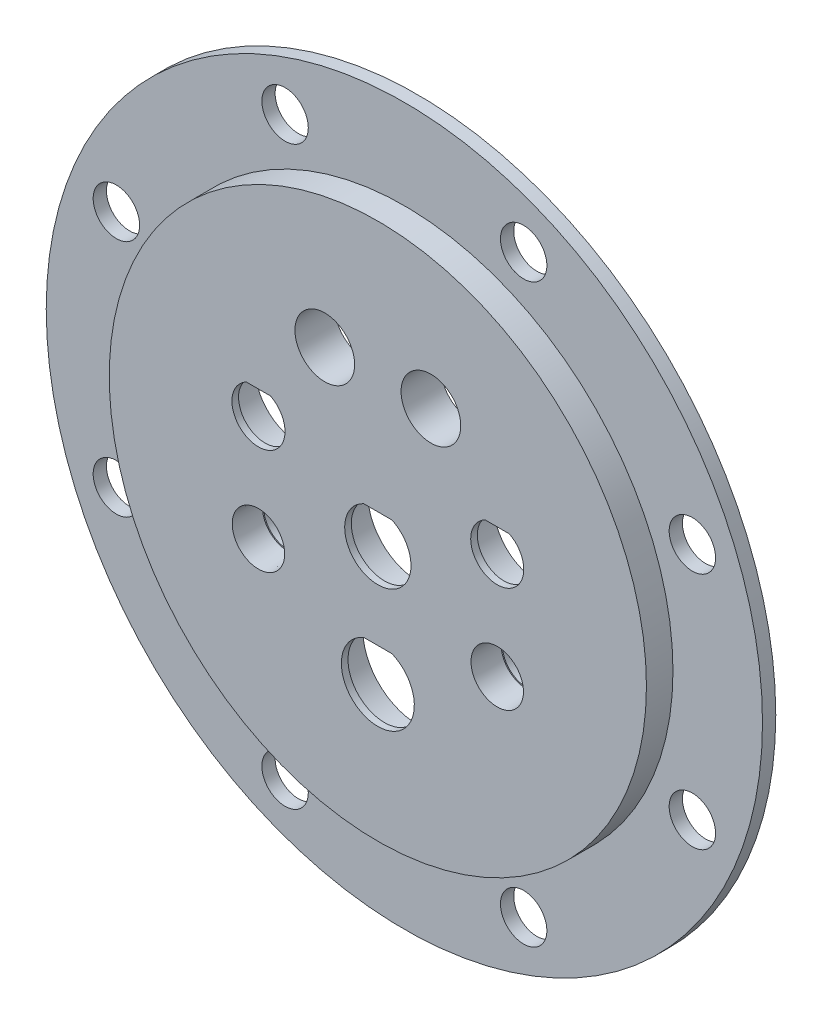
ISO-10303-21;
HEADER;
FILE_DESCRIPTION(('STEP AP214'),'2;1');
FILE_NAME('part.step','',(''),(''),'','','');
FILE_SCHEMA(('AUTOMOTIVE_DESIGN { 1 0 10303 214 1 1 1 1 }'));
ENDSEC;
DATA;
#1=APPLICATION_CONTEXT('core data for automotive mechanical design processes');
#2=APPLICATION_PROTOCOL_DEFINITION('international standard','automotive_design',2000,#1);
#3=PRODUCT_CONTEXT('',#1,'mechanical');
#4=PRODUCT('Part','Part','',(#3));
#5=PRODUCT_RELATED_PRODUCT_CATEGORY('part','',(#4));
#6=PRODUCT_DEFINITION_FORMATION('','',#4);
#7=PRODUCT_DEFINITION_CONTEXT('part definition',#1,'design');
#8=PRODUCT_DEFINITION('design','',#6,#7);
#9=PRODUCT_DEFINITION_SHAPE('','',#8);
#10=(LENGTH_UNIT() NAMED_UNIT(*) SI_UNIT(.MILLI.,.METRE.));
#11=(NAMED_UNIT(*) PLANE_ANGLE_UNIT() SI_UNIT($,.RADIAN.));
#12=(NAMED_UNIT(*) SI_UNIT($,.STERADIAN.) SOLID_ANGLE_UNIT());
#13=UNCERTAINTY_MEASURE_WITH_UNIT(LENGTH_MEASURE(1.E-05),#10,'distance_accuracy_value','');
#14=(GEOMETRIC_REPRESENTATION_CONTEXT(3) GLOBAL_UNCERTAINTY_ASSIGNED_CONTEXT((#13)) GLOBAL_UNIT_ASSIGNED_CONTEXT((#10,
#11,#12)) REPRESENTATION_CONTEXT('',''));
#15=CARTESIAN_POINT('',(0.,0.,0.));
#16=DIRECTION('',(0.,0.,1.));
#17=DIRECTION('',(1.,0.,0.));
#18=AXIS2_PLACEMENT_3D('',#15,#16,#17);
#19=CARTESIAN_POINT('',(0.,-63.5,0.));
#20=DIRECTION('',(0.,0.,1.));
#21=DIRECTION('',(1.,0.,0.));
#22=AXIS2_PLACEMENT_3D('',#19,#20,#21);
#23=CYLINDRICAL_SURFACE('',#22,17.4625);
#24=CARTESIAN_POINT('',(0.,-63.5,15.875));
#25=DIRECTION('',(0.,0.,-1.));
#26=DIRECTION('',(-1.,0.,0.));
#27=AXIS2_PLACEMENT_3D('',#24,#25,#26);
#28=CIRCLE('',#27,17.4625);
#29=CARTESIAN_POINT('',(-6.81398495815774,-47.4218,15.875));
#30=VERTEX_POINT('',#29);
#31=CARTESIAN_POINT('',(6.81398495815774,-47.4218,15.875));
#32=VERTEX_POINT('',#31);
#33=EDGE_CURVE('E50',#30,#32,#28,.F.);
#34=ORIENTED_EDGE('',*,*,#33,.F.);
#35=DIRECTION('',(0.,0.,1.));
#36=VECTOR('',#35,1.);
#37=CARTESIAN_POINT('',(-6.81398495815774,-47.4218,0.));
#38=LINE('',#37,#36);
#39=CARTESIAN_POINT('',(-6.81398495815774,-47.4218,19.05));
#40=VERTEX_POINT('',#39);
#41=EDGE_CURVE('E104',#30,#40,#38,.T.);
#42=ORIENTED_EDGE('',*,*,#41,.T.);
#43=CARTESIAN_POINT('',(0.,-63.5,19.05));
#44=DIRECTION('',(0.,0.,1.));
#45=DIRECTION('',(1.,0.,0.));
#46=AXIS2_PLACEMENT_3D('',#43,#44,#45);
#47=CIRCLE('',#46,17.4625);
#48=CARTESIAN_POINT('',(6.81398495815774,-47.4218,19.05));
#49=VERTEX_POINT('',#48);
#50=EDGE_CURVE('E478',#40,#49,#47,.T.);
#51=ORIENTED_EDGE('',*,*,#50,.T.);
#52=DIRECTION('',(0.,0.,1.));
#53=VECTOR('',#52,1.);
#54=CARTESIAN_POINT('',(6.81398495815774,-47.4218,0.));
#55=LINE('',#54,#53);
#56=EDGE_CURVE('E106',#32,#49,#55,.T.);
#57=ORIENTED_EDGE('',*,*,#56,.F.);
#58=EDGE_LOOP('',(#34,#42,#51,#57));
#59=FACE_BOUND('',#58,.T.);
#60=ADVANCED_FACE('F37',(#59),#23,.F.);
#61=CARTESIAN_POINT('',(-6.81398495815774,-47.4218,0.));
#62=DIRECTION('',(0.,1.,0.));
#63=DIRECTION('',(0.,0.,1.));
#64=AXIS2_PLACEMENT_3D('',#61,#62,#63);
#65=PLANE('',#64);
#66=DIRECTION('',(-1.,0.,0.));
#67=VECTOR('',#66,1.);
#68=CARTESIAN_POINT('',(-6.81398495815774,-47.4218,15.875));
#69=LINE('',#68,#67);
#70=EDGE_CURVE('E11',#32,#30,#69,.T.);
#71=ORIENTED_EDGE('',*,*,#70,.F.);
#72=ORIENTED_EDGE('',*,*,#56,.T.);
#73=DIRECTION('',(-1.,0.,0.));
#74=VECTOR('',#73,1.);
#75=CARTESIAN_POINT('',(-6.81398495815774,-47.4218,19.05));
#76=LINE('',#75,#74);
#77=EDGE_CURVE('E112',#49,#40,#76,.T.);
#78=ORIENTED_EDGE('',*,*,#77,.T.);
#79=ORIENTED_EDGE('',*,*,#41,.F.);
#80=EDGE_LOOP('',(#71,#72,#78,#79));
#81=FACE_BOUND('',#80,.T.);
#82=ADVANCED_FACE('F110',(#81),#65,.F.);
#83=CARTESIAN_POINT('',(0.,-6.35,0.));
#84=DIRECTION('',(0.,0.,1.));
#85=DIRECTION('',(1.,0.,0.));
#86=AXIS2_PLACEMENT_3D('',#83,#84,#85);
#87=CYLINDRICAL_SURFACE('',#86,15.875);
#88=CARTESIAN_POINT('',(0.,-6.35,15.875));
#89=DIRECTION('',(0.,0.,-1.));
#90=DIRECTION('',(-1.,0.,0.));
#91=AXIS2_PLACEMENT_3D('',#88,#89,#90);
#92=CIRCLE('',#91,15.875);
#93=CARTESIAN_POINT('',(-6.7870777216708,8.00099999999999,15.875));
#94=VERTEX_POINT('',#93);
#95=CARTESIAN_POINT('',(6.7870777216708,8.00099999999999,15.875));
#96=VERTEX_POINT('',#95);
#97=EDGE_CURVE('E57',#94,#96,#92,.F.);
#98=ORIENTED_EDGE('',*,*,#97,.F.);
#99=DIRECTION('',(0.,0.,1.));
#100=VECTOR('',#99,1.);
#101=CARTESIAN_POINT('',(-6.7870777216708,8.00099999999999,0.));
#102=LINE('',#101,#100);
#103=CARTESIAN_POINT('',(-6.7870777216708,8.00099999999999,19.05));
#104=VERTEX_POINT('',#103);
#105=EDGE_CURVE('E146',#94,#104,#102,.T.);
#106=ORIENTED_EDGE('',*,*,#105,.T.);
#107=CARTESIAN_POINT('',(0.,-6.35,19.05));
#108=DIRECTION('',(0.,0.,1.));
#109=DIRECTION('',(1.,0.,0.));
#110=AXIS2_PLACEMENT_3D('',#107,#108,#109);
#111=CIRCLE('',#110,15.875);
#112=CARTESIAN_POINT('',(6.7870777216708,8.00099999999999,19.05));
#113=VERTEX_POINT('',#112);
#114=EDGE_CURVE('E138',#104,#113,#111,.T.);
#115=ORIENTED_EDGE('',*,*,#114,.T.);
#116=DIRECTION('',(0.,0.,1.));
#117=VECTOR('',#116,1.);
#118=CARTESIAN_POINT('',(6.7870777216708,8.00099999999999,0.));
#119=LINE('',#118,#117);
#120=EDGE_CURVE('E145',#96,#113,#119,.T.);
#121=ORIENTED_EDGE('',*,*,#120,.F.);
#122=EDGE_LOOP('',(#98,#106,#115,#121));
#123=FACE_BOUND('',#122,.T.);
#124=ADVANCED_FACE('F253',(#123),#87,.F.);
#125=CARTESIAN_POINT('',(6.7870777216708,8.00099999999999,0.));
#126=DIRECTION('',(0.,1.,0.));
#127=DIRECTION('',(0.,0.,1.));
#128=AXIS2_PLACEMENT_3D('',#125,#126,#127);
#129=PLANE('',#128);
#130=DIRECTION('',(-1.,0.,0.));
#131=VECTOR('',#130,1.);
#132=CARTESIAN_POINT('',(6.7870777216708,8.00099999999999,15.875));
#133=LINE('',#132,#131);
#134=EDGE_CURVE('E45',#96,#94,#133,.T.);
#135=ORIENTED_EDGE('',*,*,#134,.F.);
#136=ORIENTED_EDGE('',*,*,#120,.T.);
#137=DIRECTION('',(-1.,0.,0.));
#138=VECTOR('',#137,1.);
#139=CARTESIAN_POINT('',(6.7870777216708,8.00099999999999,19.05));
#140=LINE('',#139,#138);
#141=EDGE_CURVE('E142',#113,#104,#140,.T.);
#142=ORIENTED_EDGE('',*,*,#141,.T.);
#143=ORIENTED_EDGE('',*,*,#105,.F.);
#144=EDGE_LOOP('',(#135,#136,#142,#143));
#145=FACE_BOUND('',#144,.T.);
#146=ADVANCED_FACE('F257',(#145),#129,.F.);
#147=CARTESIAN_POINT('',(-57.15,19.05,0.));
#148=DIRECTION('',(0.,0.,1.));
#149=DIRECTION('',(1.,0.,0.));
#150=AXIS2_PLACEMENT_3D('',#147,#148,#149);
#151=CYLINDRICAL_SURFACE('',#150,12.7);
#152=CARTESIAN_POINT('',(-57.15,19.05,15.875));
#153=DIRECTION('',(0.,0.,-1.));
#154=DIRECTION('',(-1.,0.,0.));
#155=AXIS2_PLACEMENT_3D('',#152,#153,#154);
#156=CIRCLE('',#155,12.7);
#157=CARTESIAN_POINT('',(-62.9406986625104,30.353,15.875));
#158=VERTEX_POINT('',#157);
#159=CARTESIAN_POINT('',(-51.3593013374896,30.353,15.875));
#160=VERTEX_POINT('',#159);
#161=EDGE_CURVE('E470',#158,#160,#156,.F.);
#162=ORIENTED_EDGE('',*,*,#161,.F.);
#163=DIRECTION('',(0.,0.,1.));
#164=VECTOR('',#163,1.);
#165=CARTESIAN_POINT('',(-62.9406986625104,30.353,0.));
#166=LINE('',#165,#164);
#167=CARTESIAN_POINT('',(-62.9406986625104,30.353,19.05));
#168=VERTEX_POINT('',#167);
#169=EDGE_CURVE('E136',#158,#168,#166,.T.);
#170=ORIENTED_EDGE('',*,*,#169,.T.);
#171=CARTESIAN_POINT('',(-57.15,19.05,19.05));
#172=DIRECTION('',(0.,0.,1.));
#173=DIRECTION('',(1.,0.,0.));
#174=AXIS2_PLACEMENT_3D('',#171,#172,#173);
#175=CIRCLE('',#174,12.7);
#176=CARTESIAN_POINT('',(-51.3593013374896,30.353,19.05));
#177=VERTEX_POINT('',#176);
#178=EDGE_CURVE('E128',#168,#177,#175,.T.);
#179=ORIENTED_EDGE('',*,*,#178,.T.);
#180=DIRECTION('',(0.,0.,1.));
#181=VECTOR('',#180,1.);
#182=CARTESIAN_POINT('',(-51.3593013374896,30.353,0.));
#183=LINE('',#182,#181);
#184=EDGE_CURVE('E135',#160,#177,#183,.T.);
#185=ORIENTED_EDGE('',*,*,#184,.F.);
#186=EDGE_LOOP('',(#162,#170,#179,#185));
#187=FACE_BOUND('',#186,.T.);
#188=ADVANCED_FACE('F308',(#187),#151,.F.);
#189=CARTESIAN_POINT('',(-62.9406986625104,30.353,0.));
#190=DIRECTION('',(0.,1.,0.));
#191=DIRECTION('',(0.,0.,1.));
#192=AXIS2_PLACEMENT_3D('',#189,#190,#191);
#193=PLANE('',#192);
#194=DIRECTION('',(-1.,0.,0.));
#195=VECTOR('',#194,1.);
#196=CARTESIAN_POINT('',(-62.9406986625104,30.353,15.875));
#197=LINE('',#196,#195);
#198=EDGE_CURVE('E247',#160,#158,#197,.T.);
#199=ORIENTED_EDGE('',*,*,#198,.F.);
#200=ORIENTED_EDGE('',*,*,#184,.T.);
#201=DIRECTION('',(-1.,0.,0.));
#202=VECTOR('',#201,1.);
#203=CARTESIAN_POINT('',(-62.9406986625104,30.353,19.05));
#204=LINE('',#203,#202);
#205=EDGE_CURVE('E132',#177,#168,#204,.T.);
#206=ORIENTED_EDGE('',*,*,#205,.T.);
#207=ORIENTED_EDGE('',*,*,#169,.F.);
#208=EDGE_LOOP('',(#199,#200,#206,#207));
#209=FACE_BOUND('',#208,.T.);
#210=ADVANCED_FACE('F304',(#209),#193,.F.);
#211=CARTESIAN_POINT('',(57.15,19.05,0.));
#212=DIRECTION('',(0.,0.,1.));
#213=DIRECTION('',(1.,0.,0.));
#214=AXIS2_PLACEMENT_3D('',#211,#212,#213);
#215=CYLINDRICAL_SURFACE('',#214,12.7);
#216=CARTESIAN_POINT('',(57.15,19.05,15.875));
#217=DIRECTION('',(0.,0.,-1.));
#218=DIRECTION('',(-1.,0.,0.));
#219=AXIS2_PLACEMENT_3D('',#216,#217,#218);
#220=CIRCLE('',#219,12.7);
#221=CARTESIAN_POINT('',(51.3593013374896,30.353,15.875));
#222=VERTEX_POINT('',#221);
#223=CARTESIAN_POINT('',(62.9406986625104,30.353,15.875));
#224=VERTEX_POINT('',#223);
#225=EDGE_CURVE('E473',#222,#224,#220,.F.);
#226=ORIENTED_EDGE('',*,*,#225,.F.);
#227=DIRECTION('',(0.,0.,1.));
#228=VECTOR('',#227,1.);
#229=CARTESIAN_POINT('',(51.3593013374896,30.353,0.));
#230=LINE('',#229,#228);
#231=CARTESIAN_POINT('',(51.3593013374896,30.353,19.05));
#232=VERTEX_POINT('',#231);
#233=EDGE_CURVE('E126',#222,#232,#230,.T.);
#234=ORIENTED_EDGE('',*,*,#233,.T.);
#235=CARTESIAN_POINT('',(57.15,19.05,19.05));
#236=DIRECTION('',(0.,0.,1.));
#237=DIRECTION('',(1.,0.,0.));
#238=AXIS2_PLACEMENT_3D('',#235,#236,#237);
#239=CIRCLE('',#238,12.7);
#240=CARTESIAN_POINT('',(62.9406986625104,30.353,19.05));
#241=VERTEX_POINT('',#240);
#242=EDGE_CURVE('E114',#232,#241,#239,.T.);
#243=ORIENTED_EDGE('',*,*,#242,.T.);
#244=DIRECTION('',(0.,0.,1.));
#245=VECTOR('',#244,1.);
#246=CARTESIAN_POINT('',(62.9406986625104,30.353,0.));
#247=LINE('',#246,#245);
#248=EDGE_CURVE('E125',#224,#241,#247,.T.);
#249=ORIENTED_EDGE('',*,*,#248,.F.);
#250=EDGE_LOOP('',(#226,#234,#243,#249));
#251=FACE_BOUND('',#250,.T.);
#252=ADVANCED_FACE('F300',(#251),#215,.F.);
#253=CARTESIAN_POINT('',(51.3593013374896,30.353,0.));
#254=DIRECTION('',(0.,1.,0.));
#255=DIRECTION('',(0.,0.,1.));
#256=AXIS2_PLACEMENT_3D('',#253,#254,#255);
#257=PLANE('',#256);
#258=DIRECTION('',(-1.,0.,0.));
#259=VECTOR('',#258,1.);
#260=CARTESIAN_POINT('',(51.3593013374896,30.353,15.875));
#261=LINE('',#260,#259);
#262=EDGE_CURVE('E245',#224,#222,#261,.T.);
#263=ORIENTED_EDGE('',*,*,#262,.F.);
#264=ORIENTED_EDGE('',*,*,#248,.T.);
#265=DIRECTION('',(-1.,0.,0.));
#266=VECTOR('',#265,1.);
#267=CARTESIAN_POINT('',(51.3593013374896,30.353,19.05));
#268=LINE('',#267,#266);
#269=EDGE_CURVE('E117',#241,#232,#268,.T.);
#270=ORIENTED_EDGE('',*,*,#269,.T.);
#271=ORIENTED_EDGE('',*,*,#233,.F.);
#272=EDGE_LOOP('',(#263,#264,#270,#271));
#273=FACE_BOUND('',#272,.T.);
#274=ADVANCED_FACE('F297',(#273),#257,.F.);
#275=CARTESIAN_POINT('',(0.,0.,19.05));
#276=DIRECTION('',(0.,0.,-1.));
#277=DIRECTION('',(-1.,0.,0.));
#278=AXIS2_PLACEMENT_3D('',#275,#276,#277);
#279=CYLINDRICAL_SURFACE('',#278,171.45);
#280=CARTESIAN_POINT('',(0.,0.,0.));
#281=DIRECTION('',(0.,0.,1.));
#282=DIRECTION('',(1.,0.,0.));
#283=AXIS2_PLACEMENT_3D('',#280,#281,#282);
#284=CIRCLE('',#283,171.45);
#285=CARTESIAN_POINT('',(-171.45,0.,0.));
#286=VERTEX_POINT('',#285);
#287=EDGE_CURVE('E242',#286,#286,#284,.T.);
#288=CARTESIAN_POINT('',(0.,0.,6.35));
#289=DIRECTION('',(0.,0.,1.));
#290=DIRECTION('',(1.,0.,0.));
#291=AXIS2_PLACEMENT_3D('',#288,#289,#290);
#292=CIRCLE('',#291,171.45);
#293=CARTESIAN_POINT('',(-171.45,0.,6.35));
#294=VERTEX_POINT('',#293);
#295=EDGE_CURVE('E237',#294,#294,#292,.T.);
#296=CARTESIAN_POINT('',(-171.45,0.,0.));
#297=CARTESIAN_POINT('',(-171.45,0.,0.0661458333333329));
#298=CARTESIAN_POINT('',(-171.45,0.,0.132291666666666));
#299=CARTESIAN_POINT('',(-171.45,0.,0.264583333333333));
#300=CARTESIAN_POINT('',(-171.45,0.,0.330729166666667));
#301=CARTESIAN_POINT('',(-171.45,0.,0.463020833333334));
#302=CARTESIAN_POINT('',(-171.45,0.,0.529166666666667));
#303=CARTESIAN_POINT('',(-171.45,0.,0.661458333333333));
#304=CARTESIAN_POINT('',(-171.45,0.,0.727604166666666));
#305=CARTESIAN_POINT('',(-171.45,0.,0.859895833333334));
#306=CARTESIAN_POINT('',(-171.45,0.,0.926041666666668));
#307=CARTESIAN_POINT('',(-171.45,0.,1.05833333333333));
#308=CARTESIAN_POINT('',(-171.45,0.,1.12447916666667));
#309=CARTESIAN_POINT('',(-171.45,0.,1.25677083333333));
#310=CARTESIAN_POINT('',(-171.45,0.,1.32291666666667));
#311=CARTESIAN_POINT('',(-171.45,0.,1.45520833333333));
#312=CARTESIAN_POINT('',(-171.45,0.,1.52135416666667));
#313=CARTESIAN_POINT('',(-171.45,0.,1.65364583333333));
#314=CARTESIAN_POINT('',(-171.45,0.,1.71979166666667));
#315=CARTESIAN_POINT('',(-171.45,0.,1.85208333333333));
#316=CARTESIAN_POINT('',(-171.45,0.,1.91822916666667));
#317=CARTESIAN_POINT('',(-171.45,0.,2.05052083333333));
#318=CARTESIAN_POINT('',(-171.45,0.,2.11666666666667));
#319=CARTESIAN_POINT('',(-171.45,0.,2.24895833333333));
#320=CARTESIAN_POINT('',(-171.45,0.,2.31510416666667));
#321=CARTESIAN_POINT('',(-171.45,0.,2.44739583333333));
#322=CARTESIAN_POINT('',(-171.45,0.,2.51354166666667));
#323=CARTESIAN_POINT('',(-171.45,0.,2.64583333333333));
#324=CARTESIAN_POINT('',(-171.45,0.,2.71197916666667));
#325=CARTESIAN_POINT('',(-171.45,0.,2.84427083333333));
#326=CARTESIAN_POINT('',(-171.45,0.,2.91041666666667));
#327=CARTESIAN_POINT('',(-171.45,0.,3.04270833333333));
#328=CARTESIAN_POINT('',(-171.45,0.,3.10885416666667));
#329=CARTESIAN_POINT('',(-171.45,0.,3.24114583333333));
#330=CARTESIAN_POINT('',(-171.45,0.,3.30729166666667));
#331=CARTESIAN_POINT('',(-171.45,0.,3.43958333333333));
#332=CARTESIAN_POINT('',(-171.45,0.,3.50572916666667));
#333=CARTESIAN_POINT('',(-171.45,0.,3.63802083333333));
#334=CARTESIAN_POINT('',(-171.45,0.,3.70416666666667));
#335=CARTESIAN_POINT('',(-171.45,0.,3.83645833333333));
#336=CARTESIAN_POINT('',(-171.45,0.,3.90260416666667));
#337=CARTESIAN_POINT('',(-171.45,0.,4.03489583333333));
#338=CARTESIAN_POINT('',(-171.45,0.,4.10104166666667));
#339=CARTESIAN_POINT('',(-171.45,0.,4.23333333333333));
#340=CARTESIAN_POINT('',(-171.45,0.,4.29947916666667));
#341=CARTESIAN_POINT('',(-171.45,0.,4.43177083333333));
#342=CARTESIAN_POINT('',(-171.45,0.,4.49791666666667));
#343=CARTESIAN_POINT('',(-171.45,0.,4.63020833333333));
#344=CARTESIAN_POINT('',(-171.45,0.,4.69635416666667));
#345=CARTESIAN_POINT('',(-171.45,0.,4.82864583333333));
#346=CARTESIAN_POINT('',(-171.45,0.,4.89479166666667));
#347=CARTESIAN_POINT('',(-171.45,0.,5.02708333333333));
#348=CARTESIAN_POINT('',(-171.45,0.,5.09322916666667));
#349=CARTESIAN_POINT('',(-171.45,0.,5.22552083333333));
#350=CARTESIAN_POINT('',(-171.45,0.,5.29166666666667));
#351=CARTESIAN_POINT('',(-171.45,0.,5.42395833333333));
#352=CARTESIAN_POINT('',(-171.45,0.,5.49010416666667));
#353=CARTESIAN_POINT('',(-171.45,0.,5.62239583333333));
#354=CARTESIAN_POINT('',(-171.45,0.,5.68854166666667));
#355=CARTESIAN_POINT('',(-171.45,0.,5.82083333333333));
#356=CARTESIAN_POINT('',(-171.45,0.,5.88697916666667));
#357=CARTESIAN_POINT('',(-171.45,0.,6.01927083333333));
#358=CARTESIAN_POINT('',(-171.45,0.,6.08541666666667));
#359=CARTESIAN_POINT('',(-171.45,0.,6.21770833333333));
#360=CARTESIAN_POINT('',(-171.45,0.,6.28385416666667));
#361=CARTESIAN_POINT('',(-171.45,0.,6.35));
#362=B_SPLINE_CURVE_WITH_KNOTS('',3,(#296,#297,#298,#299,#300,#301,#302,#303,#304,#305,#306,
#307,#308,#309,#310,#311,#312,#313,#314,#315,#316,#317,#318,#319,#320,#321,#322,#323,#324,#325,
#326,#327,#328,#329,#330,#331,#332,#333,#334,#335,#336,#337,#338,#339,#340,#341,#342,#343,#344,
#345,#346,#347,#348,#349,#350,#351,#352,#353,#354,#355,#356,#357,#358,#359,#360,#361),
.UNSPECIFIED.,.F.,.F.,(4,2,2,2,2,2,2,2,2,2,2,2,2,2,2,2,2,2,2,2,2,2,2,2,2,2,2,2,2,2,2,2,4),(0.,
0.198437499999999,0.396875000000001,0.5953125,0.793749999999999,0.992187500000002,1.190625,
1.3890625,1.5875,1.7859375,1.984375,2.1828125,2.38125,2.5796875,2.778125,2.9765625,3.175,
3.3734375,3.571875,3.7703125,3.96875,4.1671875,4.365625,4.5640625,4.7625,4.9609375,5.159375,
5.3578125,5.55625,5.7546875,5.953125,6.1515625,6.35),.UNSPECIFIED.);
#363=EDGE_CURVE('BSEAM39',#286,#294,#362,.T.);
#364=ORIENTED_EDGE('',*,*,#287,.T.);
#365=ORIENTED_EDGE('',*,*,#295,.F.);
#366=ORIENTED_EDGE('',*,*,#363,.T.);
#367=ORIENTED_EDGE('',*,*,#363,.F.);
#368=EDGE_LOOP('',(#364,#366,#365,#367));
#369=FACE_BOUND('',#368,.T.);
#370=ADVANCED_FACE('F39',(#369),#279,.T.);
#371=CARTESIAN_POINT('',(0.,0.,0.));
#372=DIRECTION('',(0.,0.,1.));
#373=DIRECTION('',(1.,0.,0.));
#374=AXIS2_PLACEMENT_3D('',#371,#372,#373);
#375=PLANE('',#374);
#376=CARTESIAN_POINT('',(0.,-63.5,0.));
#377=DIRECTION('',(0.,0.,-1.));
#378=DIRECTION('',(-1.,0.,0.));
#379=AXIS2_PLACEMENT_3D('',#376,#377,#378);
#380=CIRCLE('',#379,26.2509);
#381=CARTESIAN_POINT('',(-26.2509,-63.5,0.));
#382=VERTEX_POINT('',#381);
#383=EDGE_CURVE('E403',#382,#382,#380,.T.);
#384=ORIENTED_EDGE('',*,*,#383,.F.);
#385=EDGE_LOOP('',(#384));
#386=FACE_BOUND('',#385,.T.);
#387=CARTESIAN_POINT('',(0.,-6.35,0.));
#388=DIRECTION('',(0.,0.,-1.));
#389=DIRECTION('',(-1.,0.,0.));
#390=AXIS2_PLACEMENT_3D('',#387,#388,#389);
#391=CIRCLE('',#390,23.8125);
#392=CARTESIAN_POINT('',(-23.8125,-6.35,0.));
#393=VERTEX_POINT('',#392);
#394=EDGE_CURVE('E107',#393,#393,#391,.T.);
#395=ORIENTED_EDGE('',*,*,#394,.F.);
#396=EDGE_LOOP('',(#395));
#397=FACE_BOUND('',#396,.T.);
#398=CARTESIAN_POINT('',(-57.15,19.05,0.));
#399=DIRECTION('',(0.,0.,-1.));
#400=DIRECTION('',(-1.,0.,0.));
#401=AXIS2_PLACEMENT_3D('',#398,#399,#400);
#402=CIRCLE('',#401,20.6375);
#403=CARTESIAN_POINT('',(-77.7875,19.05,0.));
#404=VERTEX_POINT('',#403);
#405=EDGE_CURVE('E254',#404,#404,#402,.T.);
#406=ORIENTED_EDGE('',*,*,#405,.F.);
#407=EDGE_LOOP('',(#406));
#408=FACE_BOUND('',#407,.T.);
#409=CARTESIAN_POINT('',(57.15,19.05,0.));
#410=DIRECTION('',(0.,0.,-1.));
#411=DIRECTION('',(-1.,0.,0.));
#412=AXIS2_PLACEMENT_3D('',#409,#410,#411);
#413=CIRCLE('',#412,20.6375);
#414=CARTESIAN_POINT('',(36.5125,19.05,0.));
#415=VERTEX_POINT('',#414);
#416=EDGE_CURVE('E413',#415,#415,#413,.T.);
#417=ORIENTED_EDGE('',*,*,#416,.F.);
#418=EDGE_LOOP('',(#417));
#419=FACE_BOUND('',#418,.T.);
#420=CARTESIAN_POINT('',(25.4,63.5,0.));
#421=DIRECTION('',(0.,0.,1.));
#422=DIRECTION('',(1.,0.,0.));
#423=AXIS2_PLACEMENT_3D('',#420,#421,#422);
#424=CIRCLE('',#423,14.2875);
#425=CARTESIAN_POINT('',(39.6875,63.5,0.));
#426=VERTEX_POINT('',#425);
#427=EDGE_CURVE('E150',#426,#426,#424,.T.);
#428=ORIENTED_EDGE('',*,*,#427,.T.);
#429=EDGE_LOOP('',(#428));
#430=FACE_BOUND('',#429,.T.);
#431=CARTESIAN_POINT('',(-25.4,63.5,0.));
#432=DIRECTION('',(0.,0.,1.));
#433=DIRECTION('',(1.,0.,0.));
#434=AXIS2_PLACEMENT_3D('',#431,#432,#433);
#435=CIRCLE('',#434,14.2875);
#436=CARTESIAN_POINT('',(-11.1125,63.5,0.));
#437=VERTEX_POINT('',#436);
#438=EDGE_CURVE('E156',#437,#437,#435,.T.);
#439=ORIENTED_EDGE('',*,*,#438,.T.);
#440=EDGE_LOOP('',(#439));
#441=FACE_BOUND('',#440,.T.);
#442=CARTESIAN_POINT('',(-57.15,-31.75,0.));
#443=DIRECTION('',(0.,0.,1.));
#444=DIRECTION('',(1.,0.,0.));
#445=AXIS2_PLACEMENT_3D('',#442,#443,#444);
#446=CIRCLE('',#445,11.5062);
#447=CARTESIAN_POINT('',(-45.6438,-31.75,0.));
#448=VERTEX_POINT('',#447);
#449=EDGE_CURVE('E170',#448,#448,#446,.T.);
#450=ORIENTED_EDGE('',*,*,#449,.T.);
#451=EDGE_LOOP('',(#450));
#452=FACE_BOUND('',#451,.T.);
#453=CARTESIAN_POINT('',(57.15,-31.75,0.));
#454=DIRECTION('',(0.,0.,1.));
#455=DIRECTION('',(1.,0.,0.));
#456=AXIS2_PLACEMENT_3D('',#453,#454,#455);
#457=CIRCLE('',#456,11.5062);
#458=CARTESIAN_POINT('',(68.6562,-31.75,0.));
#459=VERTEX_POINT('',#458);
#460=EDGE_CURVE('E182',#459,#459,#457,.T.);
#461=ORIENTED_EDGE('',*,*,#460,.T.);
#462=EDGE_LOOP('',(#461));
#463=FACE_BOUND('',#462,.T.);
#464=CARTESIAN_POINT('',(57.1059351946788,137.865923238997,0.));
#465=DIRECTION('',(0.,0.,1.));
#466=DIRECTION('',(1.,0.,0.));
#467=AXIS2_PLACEMENT_3D('',#464,#465,#466);
#468=CIRCLE('',#467,11.1125);
#469=CARTESIAN_POINT('',(68.2184351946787,137.865923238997,0.));
#470=VERTEX_POINT('',#469);
#471=EDGE_CURVE('E188',#470,#470,#468,.T.);
#472=ORIENTED_EDGE('',*,*,#471,.T.);
#473=EDGE_LOOP('',(#472));
#474=FACE_BOUND('',#473,.T.);
#475=CARTESIAN_POINT('',(137.865923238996,57.105935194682,0.));
#476=DIRECTION('',(0.,0.,1.));
#477=DIRECTION('',(1.,0.,0.));
#478=AXIS2_PLACEMENT_3D('',#475,#476,#477);
#479=CIRCLE('',#478,11.1125);
#480=CARTESIAN_POINT('',(148.978423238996,57.105935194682,0.));
#481=VERTEX_POINT('',#480);
#482=EDGE_CURVE('E194',#481,#481,#479,.T.);
#483=ORIENTED_EDGE('',*,*,#482,.T.);
#484=EDGE_LOOP('',(#483));
#485=FACE_BOUND('',#484,.T.);
#486=CARTESIAN_POINT('',(137.865923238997,-57.1059351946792,0.));
#487=DIRECTION('',(0.,0.,1.));
#488=DIRECTION('',(1.,0.,0.));
#489=AXIS2_PLACEMENT_3D('',#486,#487,#488);
#490=CIRCLE('',#489,11.1125);
#491=CARTESIAN_POINT('',(148.978423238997,-57.1059351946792,0.));
#492=VERTEX_POINT('',#491);
#493=EDGE_CURVE('E200',#492,#492,#490,.T.);
#494=ORIENTED_EDGE('',*,*,#493,.T.);
#495=EDGE_LOOP('',(#494));
#496=FACE_BOUND('',#495,.T.);
#497=CARTESIAN_POINT('',(57.1059351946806,-137.865923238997,0.));
#498=DIRECTION('',(0.,0.,1.));
#499=DIRECTION('',(1.,0.,0.));
#500=AXIS2_PLACEMENT_3D('',#497,#498,#499);
#501=CIRCLE('',#500,11.1125);
#502=CARTESIAN_POINT('',(68.2184351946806,-137.865923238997,0.));
#503=VERTEX_POINT('',#502);
#504=EDGE_CURVE('E206',#503,#503,#501,.T.);
#505=ORIENTED_EDGE('',*,*,#504,.T.);
#506=EDGE_LOOP('',(#505));
#507=FACE_BOUND('',#506,.T.);
#508=CARTESIAN_POINT('',(-57.1059351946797,-137.865923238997,0.));
#509=DIRECTION('',(0.,0.,1.));
#510=DIRECTION('',(1.,0.,0.));
#511=AXIS2_PLACEMENT_3D('',#508,#509,#510);
#512=CIRCLE('',#511,11.1125);
#513=CARTESIAN_POINT('',(-45.9934351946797,-137.865923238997,0.));
#514=VERTEX_POINT('',#513);
#515=EDGE_CURVE('E212',#514,#514,#512,.T.);
#516=ORIENTED_EDGE('',*,*,#515,.T.);
#517=EDGE_LOOP('',(#516));
#518=FACE_BOUND('',#517,.T.);
#519=CARTESIAN_POINT('',(-137.865923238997,-57.1059351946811,0.));
#520=DIRECTION('',(0.,0.,1.));
#521=DIRECTION('',(1.,0.,0.));
#522=AXIS2_PLACEMENT_3D('',#519,#520,#521);
#523=CIRCLE('',#522,11.1125);
#524=CARTESIAN_POINT('',(-126.753423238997,-57.1059351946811,0.));
#525=VERTEX_POINT('',#524);
#526=EDGE_CURVE('E218',#525,#525,#523,.T.);
#527=ORIENTED_EDGE('',*,*,#526,.T.);
#528=EDGE_LOOP('',(#527));
#529=FACE_BOUND('',#528,.T.);
#530=CARTESIAN_POINT('',(-137.865923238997,57.1059351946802,0.));
#531=DIRECTION('',(0.,0.,1.));
#532=DIRECTION('',(1.,0.,0.));
#533=AXIS2_PLACEMENT_3D('',#530,#531,#532);
#534=CIRCLE('',#533,11.1125);
#535=CARTESIAN_POINT('',(-126.753423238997,57.1059351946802,0.));
#536=VERTEX_POINT('',#535);
#537=EDGE_CURVE('E224',#536,#536,#534,.T.);
#538=ORIENTED_EDGE('',*,*,#537,.T.);
#539=EDGE_LOOP('',(#538));
#540=FACE_BOUND('',#539,.T.);
#541=CARTESIAN_POINT('',(-57.1059351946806,137.865923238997,0.));
#542=DIRECTION('',(0.,0.,1.));
#543=DIRECTION('',(1.,0.,0.));
#544=AXIS2_PLACEMENT_3D('',#541,#542,#543);
#545=CIRCLE('',#544,11.1125);
#546=CARTESIAN_POINT('',(-45.9934351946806,137.865923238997,0.));
#547=VERTEX_POINT('',#546);
#548=EDGE_CURVE('E230',#547,#547,#545,.T.);
#549=ORIENTED_EDGE('',*,*,#548,.T.);
#550=EDGE_LOOP('',(#549));
#551=FACE_BOUND('',#550,.T.);
#552=ORIENTED_EDGE('',*,*,#287,.F.);
#553=EDGE_LOOP('',(#552));
#554=FACE_BOUND('',#553,.T.);
#555=ADVANCED_FACE('F285',(#386,#397,#408,#419,#430,#441,#452,#463,#474,#485,#496,#507,#518,
#529,#540,#551,#554),#375,.F.);
#556=CARTESIAN_POINT('',(0.,0.,6.35));
#557=DIRECTION('',(0.,0.,1.));
#558=DIRECTION('',(1.,0.,0.));
#559=AXIS2_PLACEMENT_3D('',#556,#557,#558);
#560=PLANE('',#559);
#561=CARTESIAN_POINT('',(57.1059351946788,137.865923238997,6.35));
#562=DIRECTION('',(0.,0.,1.));
#563=DIRECTION('',(1.,0.,0.));
#564=AXIS2_PLACEMENT_3D('',#561,#562,#563);
#565=CIRCLE('',#564,11.1125);
#566=CARTESIAN_POINT('',(68.2184351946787,137.865923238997,6.35));
#567=VERTEX_POINT('',#566);
#568=EDGE_CURVE('E185',#567,#567,#565,.T.);
#569=ORIENTED_EDGE('',*,*,#568,.F.);
#570=EDGE_LOOP('',(#569));
#571=FACE_BOUND('',#570,.T.);
#572=CARTESIAN_POINT('',(137.865923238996,57.105935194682,6.35));
#573=DIRECTION('',(0.,0.,1.));
#574=DIRECTION('',(1.,0.,0.));
#575=AXIS2_PLACEMENT_3D('',#572,#573,#574);
#576=CIRCLE('',#575,11.1125);
#577=CARTESIAN_POINT('',(148.978423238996,57.105935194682,6.35));
#578=VERTEX_POINT('',#577);
#579=EDGE_CURVE('E191',#578,#578,#576,.T.);
#580=ORIENTED_EDGE('',*,*,#579,.F.);
#581=EDGE_LOOP('',(#580));
#582=FACE_BOUND('',#581,.T.);
#583=CARTESIAN_POINT('',(137.865923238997,-57.1059351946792,6.35));
#584=DIRECTION('',(0.,0.,1.));
#585=DIRECTION('',(1.,0.,0.));
#586=AXIS2_PLACEMENT_3D('',#583,#584,#585);
#587=CIRCLE('',#586,11.1125);
#588=CARTESIAN_POINT('',(148.978423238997,-57.1059351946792,6.35));
#589=VERTEX_POINT('',#588);
#590=EDGE_CURVE('E197',#589,#589,#587,.T.);
#591=ORIENTED_EDGE('',*,*,#590,.F.);
#592=EDGE_LOOP('',(#591));
#593=FACE_BOUND('',#592,.T.);
#594=CARTESIAN_POINT('',(57.1059351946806,-137.865923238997,6.35));
#595=DIRECTION('',(0.,0.,1.));
#596=DIRECTION('',(1.,0.,0.));
#597=AXIS2_PLACEMENT_3D('',#594,#595,#596);
#598=CIRCLE('',#597,11.1125);
#599=CARTESIAN_POINT('',(68.2184351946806,-137.865923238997,6.35));
#600=VERTEX_POINT('',#599);
#601=EDGE_CURVE('E203',#600,#600,#598,.T.);
#602=ORIENTED_EDGE('',*,*,#601,.F.);
#603=EDGE_LOOP('',(#602));
#604=FACE_BOUND('',#603,.T.);
#605=CARTESIAN_POINT('',(-57.1059351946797,-137.865923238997,6.35));
#606=DIRECTION('',(0.,0.,1.));
#607=DIRECTION('',(1.,0.,0.));
#608=AXIS2_PLACEMENT_3D('',#605,#606,#607);
#609=CIRCLE('',#608,11.1125);
#610=CARTESIAN_POINT('',(-45.9934351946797,-137.865923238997,6.35));
#611=VERTEX_POINT('',#610);
#612=EDGE_CURVE('E209',#611,#611,#609,.T.);
#613=ORIENTED_EDGE('',*,*,#612,.F.);
#614=EDGE_LOOP('',(#613));
#615=FACE_BOUND('',#614,.T.);
#616=CARTESIAN_POINT('',(-137.865923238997,-57.1059351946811,6.35));
#617=DIRECTION('',(0.,0.,1.));
#618=DIRECTION('',(1.,0.,0.));
#619=AXIS2_PLACEMENT_3D('',#616,#617,#618);
#620=CIRCLE('',#619,11.1125);
#621=CARTESIAN_POINT('',(-126.753423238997,-57.1059351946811,6.35));
#622=VERTEX_POINT('',#621);
#623=EDGE_CURVE('E215',#622,#622,#620,.T.);
#624=ORIENTED_EDGE('',*,*,#623,.F.);
#625=EDGE_LOOP('',(#624));
#626=FACE_BOUND('',#625,.T.);
#627=CARTESIAN_POINT('',(-137.865923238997,57.1059351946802,6.35));
#628=DIRECTION('',(0.,0.,1.));
#629=DIRECTION('',(1.,0.,0.));
#630=AXIS2_PLACEMENT_3D('',#627,#628,#629);
#631=CIRCLE('',#630,11.1125);
#632=CARTESIAN_POINT('',(-126.753423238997,57.1059351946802,6.35));
#633=VERTEX_POINT('',#632);
#634=EDGE_CURVE('E221',#633,#633,#631,.T.);
#635=ORIENTED_EDGE('',*,*,#634,.F.);
#636=EDGE_LOOP('',(#635));
#637=FACE_BOUND('',#636,.T.);
#638=CARTESIAN_POINT('',(-57.1059351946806,137.865923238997,6.35));
#639=DIRECTION('',(0.,0.,1.));
#640=DIRECTION('',(1.,0.,0.));
#641=AXIS2_PLACEMENT_3D('',#638,#639,#640);
#642=CIRCLE('',#641,11.1125);
#643=CARTESIAN_POINT('',(-45.9934351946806,137.865923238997,6.35));
#644=VERTEX_POINT('',#643);
#645=EDGE_CURVE('E227',#644,#644,#642,.T.);
#646=ORIENTED_EDGE('',*,*,#645,.F.);
#647=EDGE_LOOP('',(#646));
#648=FACE_BOUND('',#647,.T.);
#649=CARTESIAN_POINT('',(0.,0.,6.35));
#650=DIRECTION('',(0.,0.,1.));
#651=DIRECTION('',(1.,0.,0.));
#652=AXIS2_PLACEMENT_3D('',#649,#650,#651);
#653=CIRCLE('',#652,128.5875);
#654=CARTESIAN_POINT('',(128.5875,0.,6.35));
#655=VERTEX_POINT('',#654);
#656=EDGE_CURVE('E234',#655,#655,#653,.T.);
#657=ORIENTED_EDGE('',*,*,#656,.F.);
#658=EDGE_LOOP('',(#657));
#659=FACE_BOUND('',#658,.T.);
#660=ORIENTED_EDGE('',*,*,#295,.T.);
#661=EDGE_LOOP('',(#660));
#662=FACE_BOUND('',#661,.T.);
#663=ADVANCED_FACE('F279',(#571,#582,#593,#604,#615,#626,#637,#648,#659,#662),#560,.T.);
#664=CARTESIAN_POINT('',(0.,0.,6.35));
#665=DIRECTION('',(0.,0.,1.));
#666=DIRECTION('',(1.,0.,0.));
#667=AXIS2_PLACEMENT_3D('',#664,#665,#666);
#668=CYLINDRICAL_SURFACE('',#667,128.5875);
#669=ORIENTED_EDGE('',*,*,#656,.T.);
#670=EDGE_LOOP('',(#669));
#671=FACE_BOUND('',#670,.T.);
#672=CARTESIAN_POINT('',(0.,0.,19.05));
#673=DIRECTION('',(0.,0.,1.));
#674=DIRECTION('',(1.,0.,0.));
#675=AXIS2_PLACEMENT_3D('',#672,#673,#674);
#676=CIRCLE('',#675,128.5875);
#677=CARTESIAN_POINT('',(128.5875,0.,19.05));
#678=VERTEX_POINT('',#677);
#679=EDGE_CURVE('E233',#678,#678,#676,.T.);
#680=ORIENTED_EDGE('',*,*,#679,.F.);
#681=EDGE_LOOP('',(#680));
#682=FACE_BOUND('',#681,.T.);
#683=ADVANCED_FACE('F265',(#671,#682),#668,.T.);
#684=CARTESIAN_POINT('',(0.,0.,19.05));
#685=DIRECTION('',(0.,0.,1.));
#686=DIRECTION('',(1.,0.,0.));
#687=AXIS2_PLACEMENT_3D('',#684,#685,#686);
#688=PLANE('',#687);
#689=ORIENTED_EDGE('',*,*,#50,.F.);
#690=ORIENTED_EDGE('',*,*,#77,.F.);
#691=EDGE_LOOP('',(#689,#690));
#692=FACE_BOUND('',#691,.T.);
#693=ORIENTED_EDGE('',*,*,#242,.F.);
#694=ORIENTED_EDGE('',*,*,#269,.F.);
#695=EDGE_LOOP('',(#693,#694));
#696=FACE_BOUND('',#695,.T.);
#697=ORIENTED_EDGE('',*,*,#178,.F.);
#698=ORIENTED_EDGE('',*,*,#205,.F.);
#699=EDGE_LOOP('',(#697,#698));
#700=FACE_BOUND('',#699,.T.);
#701=ORIENTED_EDGE('',*,*,#114,.F.);
#702=ORIENTED_EDGE('',*,*,#141,.F.);
#703=EDGE_LOOP('',(#701,#702));
#704=FACE_BOUND('',#703,.T.);
#705=CARTESIAN_POINT('',(25.4,63.5,19.05));
#706=DIRECTION('',(0.,0.,1.));
#707=DIRECTION('',(1.,0.,0.));
#708=AXIS2_PLACEMENT_3D('',#705,#706,#707);
#709=CIRCLE('',#708,14.2875);
#710=CARTESIAN_POINT('',(39.6875,63.5,19.05));
#711=VERTEX_POINT('',#710);
#712=EDGE_CURVE('E148',#711,#711,#709,.T.);
#713=ORIENTED_EDGE('',*,*,#712,.F.);
#714=EDGE_LOOP('',(#713));
#715=FACE_BOUND('',#714,.T.);
#716=CARTESIAN_POINT('',(-25.4,63.5,19.05));
#717=DIRECTION('',(0.,0.,1.));
#718=DIRECTION('',(1.,0.,0.));
#719=AXIS2_PLACEMENT_3D('',#716,#717,#718);
#720=CIRCLE('',#719,14.2875);
#721=CARTESIAN_POINT('',(-11.1125,63.5,19.05));
#722=VERTEX_POINT('',#721);
#723=EDGE_CURVE('E153',#722,#722,#720,.T.);
#724=ORIENTED_EDGE('',*,*,#723,.F.);
#725=EDGE_LOOP('',(#724));
#726=FACE_BOUND('',#725,.T.);
#727=CARTESIAN_POINT('',(-57.15,-31.75,19.05));
#728=DIRECTION('',(0.,0.,1.));
#729=DIRECTION('',(1.,0.,0.));
#730=AXIS2_PLACEMENT_3D('',#727,#728,#729);
#731=CIRCLE('',#730,12.5584204);
#732=CARTESIAN_POINT('',(-44.5915796,-31.75,19.05));
#733=VERTEX_POINT('',#732);
#734=EDGE_CURVE('E159',#733,#733,#731,.T.);
#735=ORIENTED_EDGE('',*,*,#734,.F.);
#736=EDGE_LOOP('',(#735));
#737=FACE_BOUND('',#736,.T.);
#738=CARTESIAN_POINT('',(57.15,-31.75,19.05));
#739=DIRECTION('',(0.,0.,1.));
#740=DIRECTION('',(1.,0.,0.));
#741=AXIS2_PLACEMENT_3D('',#738,#739,#740);
#742=CIRCLE('',#741,12.5584204);
#743=CARTESIAN_POINT('',(69.7084204,-31.75,19.05));
#744=VERTEX_POINT('',#743);
#745=EDGE_CURVE('E173',#744,#744,#742,.T.);
#746=ORIENTED_EDGE('',*,*,#745,.F.);
#747=EDGE_LOOP('',(#746));
#748=FACE_BOUND('',#747,.T.);
#749=ORIENTED_EDGE('',*,*,#679,.T.);
#750=EDGE_LOOP('',(#749));
#751=FACE_BOUND('',#750,.T.);
#752=ADVANCED_FACE('F261',(#692,#696,#700,#704,#715,#726,#737,#748,#751),#688,.T.);
#753=CARTESIAN_POINT('',(-57.1059351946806,137.865923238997,6.35));
#754=DIRECTION('',(0.,0.,1.));
#755=DIRECTION('',(1.,0.,0.));
#756=AXIS2_PLACEMENT_3D('',#753,#754,#755);
#757=CYLINDRICAL_SURFACE('',#756,11.1125);
#758=ORIENTED_EDGE('',*,*,#548,.F.);
#759=EDGE_LOOP('',(#758));
#760=FACE_BOUND('',#759,.T.);
#761=ORIENTED_EDGE('',*,*,#645,.T.);
#762=EDGE_LOOP('',(#761));
#763=FACE_BOUND('',#762,.T.);
#764=ADVANCED_FACE('F264',(#760,#763),#757,.F.);
#765=CARTESIAN_POINT('',(-137.865923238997,57.1059351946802,6.35));
#766=DIRECTION('',(0.,0.,1.));
#767=DIRECTION('',(1.,0.,0.));
#768=AXIS2_PLACEMENT_3D('',#765,#766,#767);
#769=CYLINDRICAL_SURFACE('',#768,11.1125);
#770=ORIENTED_EDGE('',*,*,#537,.F.);
#771=EDGE_LOOP('',(#770));
#772=FACE_BOUND('',#771,.T.);
#773=ORIENTED_EDGE('',*,*,#634,.T.);
#774=EDGE_LOOP('',(#773));
#775=FACE_BOUND('',#774,.T.);
#776=ADVANCED_FACE('F373',(#772,#775),#769,.F.);
#777=CARTESIAN_POINT('',(-137.865923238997,-57.1059351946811,6.35));
#778=DIRECTION('',(0.,0.,1.));
#779=DIRECTION('',(1.,0.,0.));
#780=AXIS2_PLACEMENT_3D('',#777,#778,#779);
#781=CYLINDRICAL_SURFACE('',#780,11.1125);
#782=ORIENTED_EDGE('',*,*,#526,.F.);
#783=EDGE_LOOP('',(#782));
#784=FACE_BOUND('',#783,.T.);
#785=ORIENTED_EDGE('',*,*,#623,.T.);
#786=EDGE_LOOP('',(#785));
#787=FACE_BOUND('',#786,.T.);
#788=ADVANCED_FACE('F369',(#784,#787),#781,.F.);
#789=CARTESIAN_POINT('',(-57.1059351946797,-137.865923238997,6.35));
#790=DIRECTION('',(0.,0.,1.));
#791=DIRECTION('',(1.,0.,0.));
#792=AXIS2_PLACEMENT_3D('',#789,#790,#791);
#793=CYLINDRICAL_SURFACE('',#792,11.1125);
#794=ORIENTED_EDGE('',*,*,#515,.F.);
#795=EDGE_LOOP('',(#794));
#796=FACE_BOUND('',#795,.T.);
#797=ORIENTED_EDGE('',*,*,#612,.T.);
#798=EDGE_LOOP('',(#797));
#799=FACE_BOUND('',#798,.T.);
#800=ADVANCED_FACE('F365',(#796,#799),#793,.F.);
#801=CARTESIAN_POINT('',(57.1059351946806,-137.865923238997,6.35));
#802=DIRECTION('',(0.,0.,1.));
#803=DIRECTION('',(1.,0.,0.));
#804=AXIS2_PLACEMENT_3D('',#801,#802,#803);
#805=CYLINDRICAL_SURFACE('',#804,11.1125);
#806=ORIENTED_EDGE('',*,*,#504,.F.);
#807=EDGE_LOOP('',(#806));
#808=FACE_BOUND('',#807,.T.);
#809=ORIENTED_EDGE('',*,*,#601,.T.);
#810=EDGE_LOOP('',(#809));
#811=FACE_BOUND('',#810,.T.);
#812=ADVANCED_FACE('F361',(#808,#811),#805,.F.);
#813=CARTESIAN_POINT('',(137.865923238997,-57.1059351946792,6.35));
#814=DIRECTION('',(0.,0.,1.));
#815=DIRECTION('',(1.,0.,0.));
#816=AXIS2_PLACEMENT_3D('',#813,#814,#815);
#817=CYLINDRICAL_SURFACE('',#816,11.1125);
#818=ORIENTED_EDGE('',*,*,#493,.F.);
#819=EDGE_LOOP('',(#818));
#820=FACE_BOUND('',#819,.T.);
#821=ORIENTED_EDGE('',*,*,#590,.T.);
#822=EDGE_LOOP('',(#821));
#823=FACE_BOUND('',#822,.T.);
#824=ADVANCED_FACE('F357',(#820,#823),#817,.F.);
#825=CARTESIAN_POINT('',(137.865923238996,57.105935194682,6.35));
#826=DIRECTION('',(0.,0.,1.));
#827=DIRECTION('',(1.,0.,0.));
#828=AXIS2_PLACEMENT_3D('',#825,#826,#827);
#829=CYLINDRICAL_SURFACE('',#828,11.1125);
#830=ORIENTED_EDGE('',*,*,#482,.F.);
#831=EDGE_LOOP('',(#830));
#832=FACE_BOUND('',#831,.T.);
#833=ORIENTED_EDGE('',*,*,#579,.T.);
#834=EDGE_LOOP('',(#833));
#835=FACE_BOUND('',#834,.T.);
#836=ADVANCED_FACE('F353',(#832,#835),#829,.F.);
#837=CARTESIAN_POINT('',(57.1059351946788,137.865923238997,6.35));
#838=DIRECTION('',(0.,0.,1.));
#839=DIRECTION('',(1.,0.,0.));
#840=AXIS2_PLACEMENT_3D('',#837,#838,#839);
#841=CYLINDRICAL_SURFACE('',#840,11.1125);
#842=ORIENTED_EDGE('',*,*,#471,.F.);
#843=EDGE_LOOP('',(#842));
#844=FACE_BOUND('',#843,.T.);
#845=ORIENTED_EDGE('',*,*,#568,.T.);
#846=EDGE_LOOP('',(#845));
#847=FACE_BOUND('',#846,.T.);
#848=ADVANCED_FACE('F349',(#844,#847),#841,.F.);
#849=CARTESIAN_POINT('',(57.15,-31.75,19.05));
#850=DIRECTION('',(0.,0.,1.));
#851=DIRECTION('',(1.,0.,0.));
#852=AXIS2_PLACEMENT_3D('',#849,#850,#851);
#853=CYLINDRICAL_SURFACE('',#852,11.5062);
#854=ORIENTED_EDGE('',*,*,#460,.F.);
#855=EDGE_LOOP('',(#854));
#856=FACE_BOUND('',#855,.T.);
#857=CARTESIAN_POINT('',(57.15,-31.75,5.0038));
#858=DIRECTION('',(0.,0.,1.));
#859=DIRECTION('',(1.,0.,0.));
#860=AXIS2_PLACEMENT_3D('',#857,#858,#859);
#861=CIRCLE('',#860,11.5062);
#862=CARTESIAN_POINT('',(68.6562,-31.75,5.0038));
#863=VERTEX_POINT('',#862);
#864=EDGE_CURVE('E179',#863,#863,#861,.T.);
#865=ORIENTED_EDGE('',*,*,#864,.T.);
#866=EDGE_LOOP('',(#865));
#867=FACE_BOUND('',#866,.T.);
#868=ADVANCED_FACE('F345',(#856,#867),#853,.F.);
#869=CARTESIAN_POINT('',(68.6562,-31.75,5.0038));
#870=DIRECTION('',(0.,0.,-1.));
#871=DIRECTION('',(-1.,0.,0.));
#872=AXIS2_PLACEMENT_3D('',#869,#870,#871);
#873=PLANE('',#872);
#874=ORIENTED_EDGE('',*,*,#864,.F.);
#875=EDGE_LOOP('',(#874));
#876=FACE_BOUND('',#875,.T.);
#877=CARTESIAN_POINT('',(57.15,-31.75,5.0038));
#878=DIRECTION('',(0.,0.,1.));
#879=DIRECTION('',(1.,0.,0.));
#880=AXIS2_PLACEMENT_3D('',#877,#878,#879);
#881=CIRCLE('',#880,12.1378583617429);
#882=CARTESIAN_POINT('',(69.2878583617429,-31.75,5.0038));
#883=VERTEX_POINT('',#882);
#884=EDGE_CURVE('E176',#883,#883,#881,.T.);
#885=ORIENTED_EDGE('',*,*,#884,.T.);
#886=EDGE_LOOP('',(#885));
#887=FACE_BOUND('',#886,.T.);
#888=ADVANCED_FACE('F341',(#876,#887),#873,.F.);
#889=CARTESIAN_POINT('',(57.15,-31.75,19.05));
#890=DIRECTION('',(0.,0.,1.));
#891=DIRECTION('',(1.,0.,0.));
#892=AXIS2_PLACEMENT_3D('',#889,#890,#891);
#893=CONICAL_SURFACE('',#892,12.5584204,0.0299323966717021);
#894=ORIENTED_EDGE('',*,*,#884,.F.);
#895=EDGE_LOOP('',(#894));
#896=FACE_BOUND('',#895,.T.);
#897=ORIENTED_EDGE('',*,*,#745,.T.);
#898=EDGE_LOOP('',(#897));
#899=FACE_BOUND('',#898,.T.);
#900=ADVANCED_FACE('F337',(#896,#899),#893,.F.);
#901=CARTESIAN_POINT('',(-57.15,-31.75,19.05));
#902=DIRECTION('',(0.,0.,1.));
#903=DIRECTION('',(1.,0.,0.));
#904=AXIS2_PLACEMENT_3D('',#901,#902,#903);
#905=CYLINDRICAL_SURFACE('',#904,11.5062);
#906=ORIENTED_EDGE('',*,*,#449,.F.);
#907=EDGE_LOOP('',(#906));
#908=FACE_BOUND('',#907,.T.);
#909=CARTESIAN_POINT('',(-57.15,-31.75,5.0038));
#910=DIRECTION('',(0.,0.,1.));
#911=DIRECTION('',(1.,0.,0.));
#912=AXIS2_PLACEMENT_3D('',#909,#910,#911);
#913=CIRCLE('',#912,11.5062);
#914=CARTESIAN_POINT('',(-45.6438,-31.75,5.0038));
#915=VERTEX_POINT('',#914);
#916=EDGE_CURVE('E167',#915,#915,#913,.T.);
#917=ORIENTED_EDGE('',*,*,#916,.T.);
#918=EDGE_LOOP('',(#917));
#919=FACE_BOUND('',#918,.T.);
#920=ADVANCED_FACE('F333',(#908,#919),#905,.F.);
#921=CARTESIAN_POINT('',(-45.6438,-31.75,5.0038));
#922=DIRECTION('',(0.,0.,-1.));
#923=DIRECTION('',(-1.,0.,0.));
#924=AXIS2_PLACEMENT_3D('',#921,#922,#923);
#925=PLANE('',#924);
#926=ORIENTED_EDGE('',*,*,#916,.F.);
#927=EDGE_LOOP('',(#926));
#928=FACE_BOUND('',#927,.T.);
#929=CARTESIAN_POINT('',(-57.15,-31.75,5.0038));
#930=DIRECTION('',(0.,0.,1.));
#931=DIRECTION('',(1.,0.,0.));
#932=AXIS2_PLACEMENT_3D('',#929,#930,#931);
#933=CIRCLE('',#932,12.1378583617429);
#934=CARTESIAN_POINT('',(-45.0121416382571,-31.75,5.0038));
#935=VERTEX_POINT('',#934);
#936=EDGE_CURVE('E164',#935,#935,#933,.T.);
#937=ORIENTED_EDGE('',*,*,#936,.T.);
#938=EDGE_LOOP('',(#937));
#939=FACE_BOUND('',#938,.T.);
#940=ADVANCED_FACE('F329',(#928,#939),#925,.F.);
#941=CARTESIAN_POINT('',(-57.15,-31.75,19.05));
#942=DIRECTION('',(0.,0.,1.));
#943=DIRECTION('',(1.,0.,0.));
#944=AXIS2_PLACEMENT_3D('',#941,#942,#943);
#945=CONICAL_SURFACE('',#944,12.5584204,0.029932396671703);
#946=ORIENTED_EDGE('',*,*,#936,.F.);
#947=EDGE_LOOP('',(#946));
#948=FACE_BOUND('',#947,.T.);
#949=ORIENTED_EDGE('',*,*,#734,.T.);
#950=EDGE_LOOP('',(#949));
#951=FACE_BOUND('',#950,.T.);
#952=ADVANCED_FACE('F325',(#948,#951),#945,.F.);
#953=CARTESIAN_POINT('',(-25.4,63.5,0.));
#954=DIRECTION('',(0.,0.,1.));
#955=DIRECTION('',(1.,0.,0.));
#956=AXIS2_PLACEMENT_3D('',#953,#954,#955);
#957=CYLINDRICAL_SURFACE('',#956,14.2875);
#958=CARTESIAN_POINT('',(-11.1125,63.5,0.));
#959=CARTESIAN_POINT('',(-11.1125,63.5,0.1984375));
#960=CARTESIAN_POINT('',(-11.1125,63.5,0.396875));
#961=CARTESIAN_POINT('',(-11.1125,63.5,0.79375));
#962=CARTESIAN_POINT('',(-11.1125,63.5,0.9921875));
#963=CARTESIAN_POINT('',(-11.1125,63.5,1.3890625));
#964=CARTESIAN_POINT('',(-11.1125,63.5,1.5875));
#965=CARTESIAN_POINT('',(-11.1125,63.5,1.984375));
#966=CARTESIAN_POINT('',(-11.1125,63.5,2.1828125));
#967=CARTESIAN_POINT('',(-11.1125,63.5,2.5796875));
#968=CARTESIAN_POINT('',(-11.1125,63.5,2.778125));
#969=CARTESIAN_POINT('',(-11.1125,63.5,3.175));
#970=CARTESIAN_POINT('',(-11.1125,63.5,3.3734375));
#971=CARTESIAN_POINT('',(-11.1125,63.5,3.7703125));
#972=CARTESIAN_POINT('',(-11.1125,63.5,3.96875));
#973=CARTESIAN_POINT('',(-11.1125,63.5,4.365625));
#974=CARTESIAN_POINT('',(-11.1125,63.5,4.5640625));
#975=CARTESIAN_POINT('',(-11.1125,63.5,4.9609375));
#976=CARTESIAN_POINT('',(-11.1125,63.5,5.159375));
#977=CARTESIAN_POINT('',(-11.1125,63.5,5.55625));
#978=CARTESIAN_POINT('',(-11.1125,63.5,5.7546875));
#979=CARTESIAN_POINT('',(-11.1125,63.5,6.1515625));
#980=CARTESIAN_POINT('',(-11.1125,63.5,6.35));
#981=CARTESIAN_POINT('',(-11.1125,63.5,6.746875));
#982=CARTESIAN_POINT('',(-11.1125,63.5,6.9453125));
#983=CARTESIAN_POINT('',(-11.1125,63.5,7.3421875));
#984=CARTESIAN_POINT('',(-11.1125,63.5,7.540625));
#985=CARTESIAN_POINT('',(-11.1125,63.5,7.9375));
#986=CARTESIAN_POINT('',(-11.1125,63.5,8.1359375));
#987=CARTESIAN_POINT('',(-11.1125,63.5,8.5328125));
#988=CARTESIAN_POINT('',(-11.1125,63.5,8.73125));
#989=CARTESIAN_POINT('',(-11.1125,63.5,9.128125));
#990=CARTESIAN_POINT('',(-11.1125,63.5,9.3265625));
#991=CARTESIAN_POINT('',(-11.1125,63.5,9.7234375));
#992=CARTESIAN_POINT('',(-11.1125,63.5,9.921875));
#993=CARTESIAN_POINT('',(-11.1125,63.5,10.31875));
#994=CARTESIAN_POINT('',(-11.1125,63.5,10.5171875));
#995=CARTESIAN_POINT('',(-11.1125,63.5,10.9140625));
#996=CARTESIAN_POINT('',(-11.1125,63.5,11.1125));
#997=CARTESIAN_POINT('',(-11.1125,63.5,11.509375));
#998=CARTESIAN_POINT('',(-11.1125,63.5,11.7078125));
#999=CARTESIAN_POINT('',(-11.1125,63.5,12.1046875));
#1000=CARTESIAN_POINT('',(-11.1125,63.5,12.303125));
#1001=CARTESIAN_POINT('',(-11.1125,63.5,12.7));
#1002=CARTESIAN_POINT('',(-11.1125,63.5,12.8984375));
#1003=CARTESIAN_POINT('',(-11.1125,63.5,13.2953125));
#1004=CARTESIAN_POINT('',(-11.1125,63.5,13.49375));
#1005=CARTESIAN_POINT('',(-11.1125,63.5,13.890625));
#1006=CARTESIAN_POINT('',(-11.1125,63.5,14.0890625));
#1007=CARTESIAN_POINT('',(-11.1125,63.5,14.4859375));
#1008=CARTESIAN_POINT('',(-11.1125,63.5,14.684375));
#1009=CARTESIAN_POINT('',(-11.1125,63.5,15.08125));
#1010=CARTESIAN_POINT('',(-11.1125,63.5,15.2796875));
#1011=CARTESIAN_POINT('',(-11.1125,63.5,15.6765625));
#1012=CARTESIAN_POINT('',(-11.1125,63.5,15.875));
#1013=CARTESIAN_POINT('',(-11.1125,63.5,16.271875));
#1014=CARTESIAN_POINT('',(-11.1125,63.5,16.4703125));
#1015=CARTESIAN_POINT('',(-11.1125,63.5,16.8671875));
#1016=CARTESIAN_POINT('',(-11.1125,63.5,17.065625));
#1017=CARTESIAN_POINT('',(-11.1125,63.5,17.4625));
#1018=CARTESIAN_POINT('',(-11.1125,63.5,17.6609375));
#1019=CARTESIAN_POINT('',(-11.1125,63.5,18.0578125));
#1020=CARTESIAN_POINT('',(-11.1125,63.5,18.25625));
#1021=CARTESIAN_POINT('',(-11.1125,63.5,18.653125));
#1022=CARTESIAN_POINT('',(-11.1125,63.5,18.8515625));
#1023=CARTESIAN_POINT('',(-11.1125,63.5,19.05));
#1024=B_SPLINE_CURVE_WITH_KNOTS('',3,(#958,#959,#960,#961,#962,#963,#964,#965,#966,#967,#968,
#969,#970,#971,#972,#973,#974,#975,#976,#977,#978,#979,#980,#981,#982,#983,#984,#985,#986,#987,
#988,#989,#990,#991,#992,#993,#994,#995,#996,#997,#998,#999,#1000,#1001,#1002,#1003,#1004,#1005,
#1006,#1007,#1008,#1009,#1010,#1011,#1012,#1013,#1014,#1015,#1016,#1017,#1018,#1019,#1020,#1021,
#1022,#1023),.UNSPECIFIED.,.F.,.F.,(4,2,2,2,2,2,2,2,2,2,2,2,2,2,2,2,2,2,2,2,2,2,2,2,2,2,2,2,2,2,
2,2,4),(0.,0.5953125,1.190625,1.7859375,2.38125,2.9765625,3.571875,4.1671875,4.7625,5.3578125,
5.953125,6.5484375,7.14375,7.7390625,8.334375,8.9296875,9.525,10.1203125,10.715625,11.3109375,
11.90625,12.5015625,13.096875,13.6921875,14.2875,14.8828125,15.478125,16.0734375,16.66875,
17.2640625,17.859375,18.4546875,19.05),.UNSPECIFIED.);
#1025=EDGE_CURVE('BSEAM321',#437,#722,#1024,.T.);
#1026=ORIENTED_EDGE('',*,*,#438,.F.);
#1027=ORIENTED_EDGE('',*,*,#723,.T.);
#1028=ORIENTED_EDGE('',*,*,#1025,.T.);
#1029=ORIENTED_EDGE('',*,*,#1025,.F.);
#1030=EDGE_LOOP('',(#1026,#1028,#1027,#1029));
#1031=FACE_BOUND('',#1030,.T.);
#1032=ADVANCED_FACE('F321',(#1031),#957,.F.);
#1033=CARTESIAN_POINT('',(25.4,63.5,0.));
#1034=DIRECTION('',(0.,0.,1.));
#1035=DIRECTION('',(1.,0.,0.));
#1036=AXIS2_PLACEMENT_3D('',#1033,#1034,#1035);
#1037=CYLINDRICAL_SURFACE('',#1036,14.2875);
#1038=CARTESIAN_POINT('',(39.6875,63.5,0.));
#1039=CARTESIAN_POINT('',(39.6875,63.5,0.1984375));
#1040=CARTESIAN_POINT('',(39.6875,63.5,0.396875));
#1041=CARTESIAN_POINT('',(39.6875,63.5,0.79375));
#1042=CARTESIAN_POINT('',(39.6875,63.5,0.9921875));
#1043=CARTESIAN_POINT('',(39.6875,63.5,1.3890625));
#1044=CARTESIAN_POINT('',(39.6875,63.5,1.5875));
#1045=CARTESIAN_POINT('',(39.6875,63.5,1.984375));
#1046=CARTESIAN_POINT('',(39.6875,63.5,2.1828125));
#1047=CARTESIAN_POINT('',(39.6875,63.5,2.5796875));
#1048=CARTESIAN_POINT('',(39.6875,63.5,2.778125));
#1049=CARTESIAN_POINT('',(39.6875,63.5,3.175));
#1050=CARTESIAN_POINT('',(39.6875,63.5,3.3734375));
#1051=CARTESIAN_POINT('',(39.6875,63.5,3.7703125));
#1052=CARTESIAN_POINT('',(39.6875,63.5,3.96875));
#1053=CARTESIAN_POINT('',(39.6875,63.5,4.365625));
#1054=CARTESIAN_POINT('',(39.6875,63.5,4.5640625));
#1055=CARTESIAN_POINT('',(39.6875,63.5,4.9609375));
#1056=CARTESIAN_POINT('',(39.6875,63.5,5.159375));
#1057=CARTESIAN_POINT('',(39.6875,63.5,5.55625));
#1058=CARTESIAN_POINT('',(39.6875,63.5,5.7546875));
#1059=CARTESIAN_POINT('',(39.6875,63.5,6.1515625));
#1060=CARTESIAN_POINT('',(39.6875,63.5,6.35));
#1061=CARTESIAN_POINT('',(39.6875,63.5,6.746875));
#1062=CARTESIAN_POINT('',(39.6875,63.5,6.9453125));
#1063=CARTESIAN_POINT('',(39.6875,63.5,7.3421875));
#1064=CARTESIAN_POINT('',(39.6875,63.5,7.540625));
#1065=CARTESIAN_POINT('',(39.6875,63.5,7.9375));
#1066=CARTESIAN_POINT('',(39.6875,63.5,8.1359375));
#1067=CARTESIAN_POINT('',(39.6875,63.5,8.5328125));
#1068=CARTESIAN_POINT('',(39.6875,63.5,8.73125));
#1069=CARTESIAN_POINT('',(39.6875,63.5,9.128125));
#1070=CARTESIAN_POINT('',(39.6875,63.5,9.3265625));
#1071=CARTESIAN_POINT('',(39.6875,63.5,9.7234375));
#1072=CARTESIAN_POINT('',(39.6875,63.5,9.921875));
#1073=CARTESIAN_POINT('',(39.6875,63.5,10.31875));
#1074=CARTESIAN_POINT('',(39.6875,63.5,10.5171875));
#1075=CARTESIAN_POINT('',(39.6875,63.5,10.9140625));
#1076=CARTESIAN_POINT('',(39.6875,63.5,11.1125));
#1077=CARTESIAN_POINT('',(39.6875,63.5,11.509375));
#1078=CARTESIAN_POINT('',(39.6875,63.5,11.7078125));
#1079=CARTESIAN_POINT('',(39.6875,63.5,12.1046875));
#1080=CARTESIAN_POINT('',(39.6875,63.5,12.303125));
#1081=CARTESIAN_POINT('',(39.6875,63.5,12.7));
#1082=CARTESIAN_POINT('',(39.6875,63.5,12.8984375));
#1083=CARTESIAN_POINT('',(39.6875,63.5,13.2953125));
#1084=CARTESIAN_POINT('',(39.6875,63.5,13.49375));
#1085=CARTESIAN_POINT('',(39.6875,63.5,13.890625));
#1086=CARTESIAN_POINT('',(39.6875,63.5,14.0890625));
#1087=CARTESIAN_POINT('',(39.6875,63.5,14.4859375));
#1088=CARTESIAN_POINT('',(39.6875,63.5,14.684375));
#1089=CARTESIAN_POINT('',(39.6875,63.5,15.08125));
#1090=CARTESIAN_POINT('',(39.6875,63.5,15.2796875));
#1091=CARTESIAN_POINT('',(39.6875,63.5,15.6765625));
#1092=CARTESIAN_POINT('',(39.6875,63.5,15.875));
#1093=CARTESIAN_POINT('',(39.6875,63.5,16.271875));
#1094=CARTESIAN_POINT('',(39.6875,63.5,16.4703125));
#1095=CARTESIAN_POINT('',(39.6875,63.5,16.8671875));
#1096=CARTESIAN_POINT('',(39.6875,63.5,17.065625));
#1097=CARTESIAN_POINT('',(39.6875,63.5,17.4625));
#1098=CARTESIAN_POINT('',(39.6875,63.5,17.6609375));
#1099=CARTESIAN_POINT('',(39.6875,63.5,18.0578125));
#1100=CARTESIAN_POINT('',(39.6875,63.5,18.25625));
#1101=CARTESIAN_POINT('',(39.6875,63.5,18.653125));
#1102=CARTESIAN_POINT('',(39.6875,63.5,18.8515625));
#1103=CARTESIAN_POINT('',(39.6875,63.5,19.05));
#1104=B_SPLINE_CURVE_WITH_KNOTS('',3,(#1038,#1039,#1040,#1041,#1042,#1043,#1044,#1045,#1046,
#1047,#1048,#1049,#1050,#1051,#1052,#1053,#1054,#1055,#1056,#1057,#1058,#1059,#1060,#1061,#1062,
#1063,#1064,#1065,#1066,#1067,#1068,#1069,#1070,#1071,#1072,#1073,#1074,#1075,#1076,#1077,#1078,
#1079,#1080,#1081,#1082,#1083,#1084,#1085,#1086,#1087,#1088,#1089,#1090,#1091,#1092,#1093,#1094,
#1095,#1096,#1097,#1098,#1099,#1100,#1101,#1102,#1103),.UNSPECIFIED.,.F.,.F.,(4,2,2,2,2,2,2,2,2,
2,2,2,2,2,2,2,2,2,2,2,2,2,2,2,2,2,2,2,2,2,2,2,4),(0.,0.5953125,1.190625,1.7859375,2.38125,
2.9765625,3.571875,4.1671875,4.7625,5.3578125,5.953125,6.5484375,7.14375,7.7390625,8.334375,
8.9296875,9.525,10.1203125,10.715625,11.3109375,11.90625,12.5015625,13.096875,13.6921875,
14.2875,14.8828125,15.478125,16.0734375,16.66875,17.2640625,17.859375,18.4546875,19.05),.UNSPECIFIED.);
#1105=EDGE_CURVE('BSEAM317',#426,#711,#1104,.T.);
#1106=ORIENTED_EDGE('',*,*,#427,.F.);
#1107=ORIENTED_EDGE('',*,*,#712,.T.);
#1108=ORIENTED_EDGE('',*,*,#1105,.T.);
#1109=ORIENTED_EDGE('',*,*,#1105,.F.);
#1110=EDGE_LOOP('',(#1106,#1108,#1107,#1109));
#1111=FACE_BOUND('',#1110,.T.);
#1112=ADVANCED_FACE('F317',(#1111),#1037,.F.);
#1113=CARTESIAN_POINT('',(57.15,19.05,15.875));
#1114=DIRECTION('',(0.,0.,-1.));
#1115=DIRECTION('',(-1.,0.,0.));
#1116=AXIS2_PLACEMENT_3D('',#1113,#1114,#1115);
#1117=PLANE('',#1116);
#1118=CARTESIAN_POINT('',(57.15,19.05,15.875));
#1119=DIRECTION('',(0.,0.,-1.));
#1120=DIRECTION('',(-1.,0.,0.));
#1121=AXIS2_PLACEMENT_3D('',#1118,#1119,#1120);
#1122=CIRCLE('',#1121,20.6375);
#1123=CARTESIAN_POINT('',(36.5125,19.05,15.875));
#1124=VERTEX_POINT('',#1123);
#1125=EDGE_CURVE('E469',#1124,#1124,#1122,.T.);
#1126=ORIENTED_EDGE('',*,*,#1125,.T.);
#1127=EDGE_LOOP('',(#1126));
#1128=FACE_BOUND('',#1127,.T.);
#1129=ORIENTED_EDGE('',*,*,#225,.T.);
#1130=ORIENTED_EDGE('',*,*,#262,.T.);
#1131=EDGE_LOOP('',(#1129,#1130));
#1132=FACE_BOUND('',#1131,.T.);
#1133=ADVANCED_FACE('F320',(#1128,#1132),#1117,.T.);
#1134=CARTESIAN_POINT('',(57.15,19.05,15.875));
#1135=DIRECTION('',(0.,0.,-1.));
#1136=DIRECTION('',(-1.,0.,0.));
#1137=AXIS2_PLACEMENT_3D('',#1134,#1135,#1136);
#1138=CYLINDRICAL_SURFACE('',#1137,20.6375);
#1139=ORIENTED_EDGE('',*,*,#1125,.F.);
#1140=EDGE_LOOP('',(#1139));
#1141=FACE_BOUND('',#1140,.T.);
#1142=ORIENTED_EDGE('',*,*,#416,.T.);
#1143=EDGE_LOOP('',(#1142));
#1144=FACE_BOUND('',#1143,.T.);
#1145=ADVANCED_FACE('F493',(#1141,#1144),#1138,.F.);
#1146=CARTESIAN_POINT('',(-57.15,19.05,15.875));
#1147=DIRECTION('',(0.,0.,-1.));
#1148=DIRECTION('',(-1.,0.,0.));
#1149=AXIS2_PLACEMENT_3D('',#1146,#1147,#1148);
#1150=PLANE('',#1149);
#1151=CARTESIAN_POINT('',(-57.15,19.05,15.875));
#1152=DIRECTION('',(0.,0.,-1.));
#1153=DIRECTION('',(-1.,0.,0.));
#1154=AXIS2_PLACEMENT_3D('',#1151,#1152,#1153);
#1155=CIRCLE('',#1154,20.6375);
#1156=CARTESIAN_POINT('',(-77.7875,19.05,15.875));
#1157=VERTEX_POINT('',#1156);
#1158=EDGE_CURVE('E475',#1157,#1157,#1155,.T.);
#1159=ORIENTED_EDGE('',*,*,#1158,.T.);
#1160=EDGE_LOOP('',(#1159));
#1161=FACE_BOUND('',#1160,.T.);
#1162=ORIENTED_EDGE('',*,*,#161,.T.);
#1163=ORIENTED_EDGE('',*,*,#198,.T.);
#1164=EDGE_LOOP('',(#1162,#1163));
#1165=FACE_BOUND('',#1164,.T.);
#1166=ADVANCED_FACE('F490',(#1161,#1165),#1150,.T.);
#1167=CARTESIAN_POINT('',(-57.15,19.05,15.875));
#1168=DIRECTION('',(0.,0.,-1.));
#1169=DIRECTION('',(-1.,0.,0.));
#1170=AXIS2_PLACEMENT_3D('',#1167,#1168,#1169);
#1171=CYLINDRICAL_SURFACE('',#1170,20.6375);
#1172=ORIENTED_EDGE('',*,*,#1158,.F.);
#1173=EDGE_LOOP('',(#1172));
#1174=FACE_BOUND('',#1173,.T.);
#1175=ORIENTED_EDGE('',*,*,#405,.T.);
#1176=EDGE_LOOP('',(#1175));
#1177=FACE_BOUND('',#1176,.T.);
#1178=ADVANCED_FACE('F492',(#1174,#1177),#1171,.F.);
#1179=CARTESIAN_POINT('',(0.,-6.35,15.875));
#1180=DIRECTION('',(0.,0.,-1.));
#1181=DIRECTION('',(-1.,0.,0.));
#1182=AXIS2_PLACEMENT_3D('',#1179,#1180,#1181);
#1183=PLANE('',#1182);
#1184=CARTESIAN_POINT('',(0.,-6.35,15.875));
#1185=DIRECTION('',(0.,0.,-1.));
#1186=DIRECTION('',(-1.,0.,0.));
#1187=AXIS2_PLACEMENT_3D('',#1184,#1185,#1186);
#1188=CIRCLE('',#1187,23.8125);
#1189=CARTESIAN_POINT('',(-23.8125,-6.35,15.875));
#1190=VERTEX_POINT('',#1189);
#1191=EDGE_CURVE('E255',#1190,#1190,#1188,.T.);
#1192=ORIENTED_EDGE('',*,*,#1191,.T.);
#1193=EDGE_LOOP('',(#1192));
#1194=FACE_BOUND('',#1193,.T.);
#1195=ORIENTED_EDGE('',*,*,#97,.T.);
#1196=ORIENTED_EDGE('',*,*,#134,.T.);
#1197=EDGE_LOOP('',(#1195,#1196));
#1198=FACE_BOUND('',#1197,.T.);
#1199=ADVANCED_FACE('F248',(#1194,#1198),#1183,.T.);
#1200=CARTESIAN_POINT('',(0.,-6.35,15.875));
#1201=DIRECTION('',(0.,0.,-1.));
#1202=DIRECTION('',(-1.,0.,0.));
#1203=AXIS2_PLACEMENT_3D('',#1200,#1201,#1202);
#1204=CYLINDRICAL_SURFACE('',#1203,23.8125);
#1205=ORIENTED_EDGE('',*,*,#1191,.F.);
#1206=EDGE_LOOP('',(#1205));
#1207=FACE_BOUND('',#1206,.T.);
#1208=ORIENTED_EDGE('',*,*,#394,.T.);
#1209=EDGE_LOOP('',(#1208));
#1210=FACE_BOUND('',#1209,.T.);
#1211=ADVANCED_FACE('F505',(#1207,#1210),#1204,.F.);
#1212=CARTESIAN_POINT('',(0.,-63.5,15.875));
#1213=DIRECTION('',(0.,0.,-1.));
#1214=DIRECTION('',(-1.,0.,0.));
#1215=AXIS2_PLACEMENT_3D('',#1212,#1213,#1214);
#1216=PLANE('',#1215);
#1217=CARTESIAN_POINT('',(0.,-63.5,15.875));
#1218=DIRECTION('',(0.,0.,-1.));
#1219=DIRECTION('',(-1.,0.,0.));
#1220=AXIS2_PLACEMENT_3D('',#1217,#1218,#1219);
#1221=CIRCLE('',#1220,26.2509);
#1222=CARTESIAN_POINT('',(-26.2509,-63.5,15.875));
#1223=VERTEX_POINT('',#1222);
#1224=EDGE_CURVE('E108',#1223,#1223,#1221,.T.);
#1225=ORIENTED_EDGE('',*,*,#1224,.T.);
#1226=EDGE_LOOP('',(#1225));
#1227=FACE_BOUND('',#1226,.T.);
#1228=ORIENTED_EDGE('',*,*,#33,.T.);
#1229=ORIENTED_EDGE('',*,*,#70,.T.);
#1230=EDGE_LOOP('',(#1228,#1229));
#1231=FACE_BOUND('',#1230,.T.);
#1232=ADVANCED_FACE('F98',(#1227,#1231),#1216,.T.);
#1233=CARTESIAN_POINT('',(0.,-63.5,15.875));
#1234=DIRECTION('',(0.,0.,-1.));
#1235=DIRECTION('',(-1.,0.,0.));
#1236=AXIS2_PLACEMENT_3D('',#1233,#1234,#1235);
#1237=CYLINDRICAL_SURFACE('',#1236,26.2509);
#1238=ORIENTED_EDGE('',*,*,#1224,.F.);
#1239=EDGE_LOOP('',(#1238));
#1240=FACE_BOUND('',#1239,.T.);
#1241=ORIENTED_EDGE('',*,*,#383,.T.);
#1242=EDGE_LOOP('',(#1241));
#1243=FACE_BOUND('',#1242,.T.);
#1244=ADVANCED_FACE('F559',(#1240,#1243),#1237,.F.);
#1245=CLOSED_SHELL('',(#60,#82,#124,#146,#188,#210,#252,#274,#370,#555,#663,#683,#752,#764,#776,
#788,#800,#812,#824,#836,#848,#868,#888,#900,#920,#940,#952,#1032,#1112,#1133,#1145,#1166,#1178,
#1199,#1211,#1232,#1244));
#1246=MANIFOLD_SOLID_BREP('B2',#1245);
#1247=ADVANCED_BREP_SHAPE_REPRESENTATION('',(#18,#1246),#14);
#1248=SHAPE_DEFINITION_REPRESENTATION(#9,#1247);
ENDSEC;
END-ISO-10303-21;
